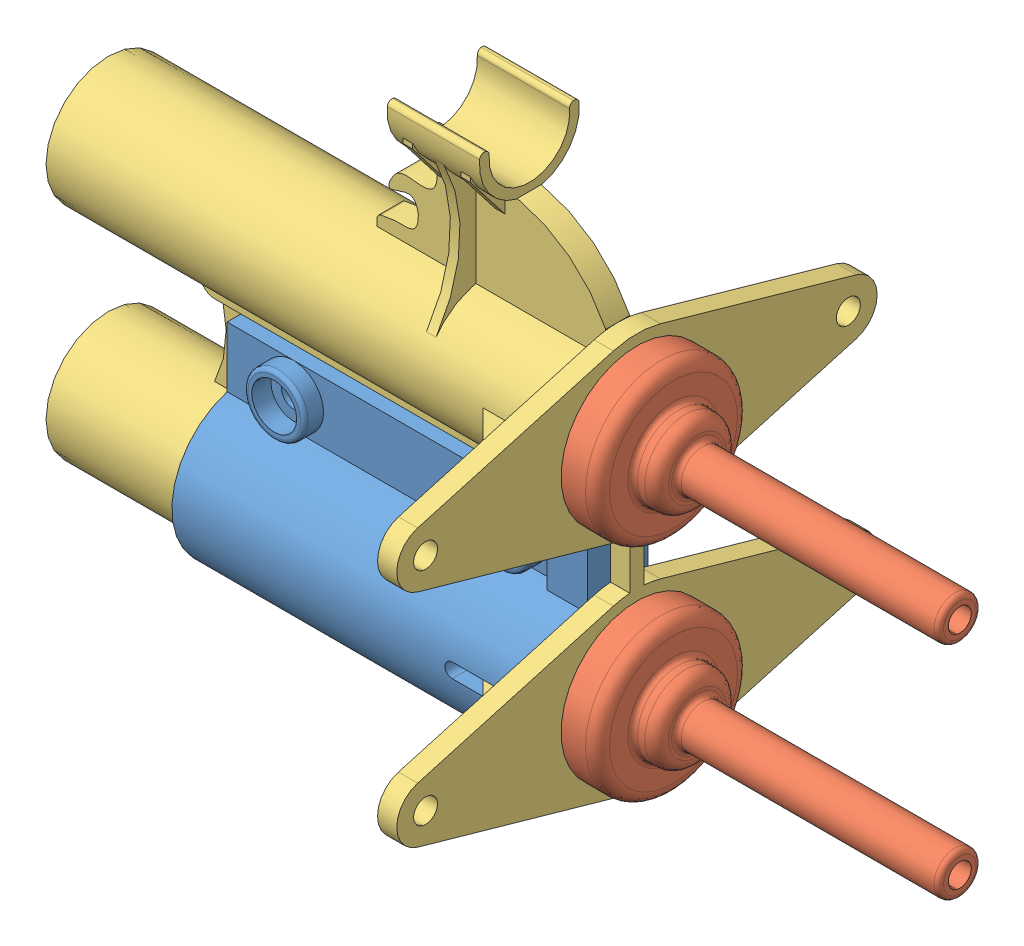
SolidWorks assembly SUB_body.SLDASM, configuration Default (file format 3100). Lengths in mm.
Overall size (112.52 68.72 63.5).
4 component instances, 3 part files, 9 mates.
Components (placement in the parent):
- Finger Grip-1: Finger Grip.SLDPRT [Default] at origin size (48.77 27.9 20.32)
- Nozzle-1: Nozzle.SLDPRT [Default] at (2.54 29.21 0) x (0 -1 0) z (0 0 1) size (20.07 42.67 20.07)
- Nozzle-2: Nozzle.SLDPRT [Default] at (2.54 0 0) x (0 -1 0) z (0 0 1) size (20.07 42.67 20.07)
- Main Body-1: Main Body.SLDPRT [Default] at (2.54 0 0) size (71.75 68.72 63.5)
Mates (geometry in assembly coordinates):
- Concentric1: concentric aligned: cylinder of Finger Grip-1; cylinder of Main Body-1
- Parallel1: parallel anti-aligned: plane of Finger Grip-1; plane of Main Body-1
- Coincident1: coincident anti-aligned: plane of Finger Grip-1; plane of Main Body-1
- Coincident2: coincident anti-aligned: plane of Nozzle-1; plane of Main Body-1
- Parallel2: parallel aligned: plane of Nozzle-1; plane of Main Body-1
- Concentric2: concentric aligned: cylinder of Nozzle-1; cylinder of Main Body-1
- Concentric3: concentric aligned: cylinder of Nozzle-2; cylinder of Main Body-1
- Coincident3: coincident anti-aligned: plane of Nozzle-2; plane of Main Body-1
- Parallel3: parallel aligned: plane of Nozzle-2; plane of Main Body-1
